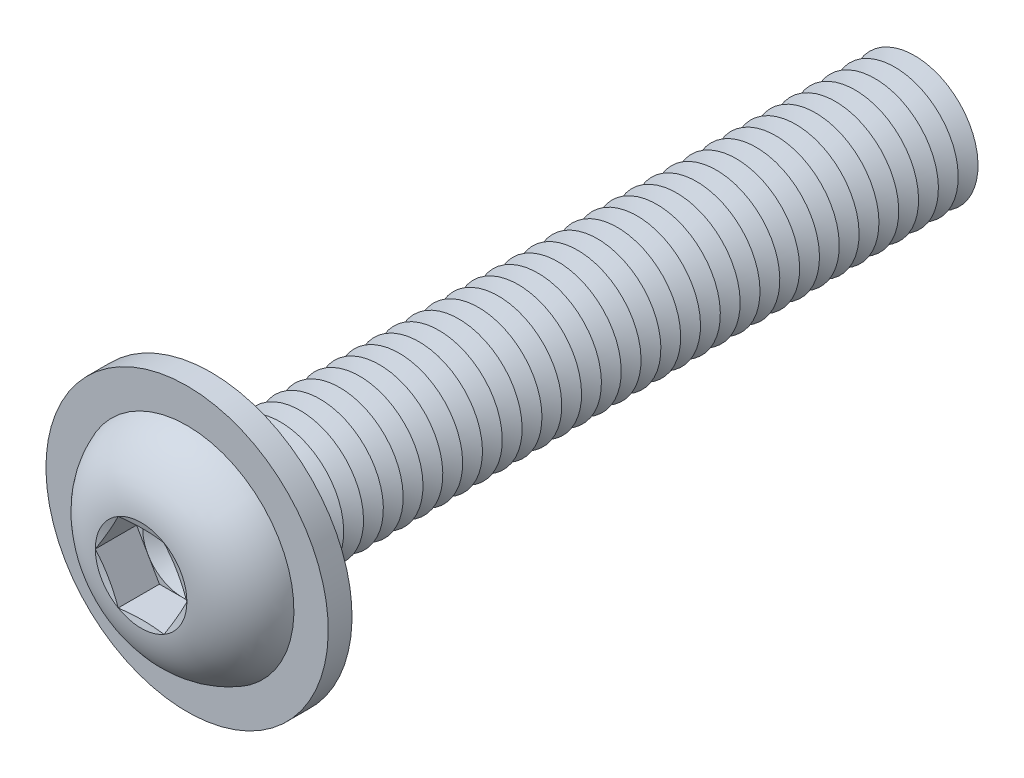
from build123d import *

# Parameters (mm, degrees)
FILLET1_R           = 0.625
LPATTERN1_COUNT     = 36
LPATTERN1_PITCH     = 1.25
CUT_EXTRUDE1_DEPTH  = 2.6
SKETCH5_R           = 8.9
SKETCH5_R_2         = 4.625
BOSS_EXTRUDE1_DEPTH = 1.5


with BuildPart() as part:
    # Sketch1 → Revolve1 (revolve)
    with BuildSketch(Plane(origin=(0, 0, 0), x_dir=(0, 0, -1), z_dir=(1, 0, 0))):
        with BuildLine():
            Line((0, 4), (0, 7))
            ThreePointArc((0, 7), (-3.011595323, 5.81154966), (-4.4, 2.88675))
            Line((-4.4, 2.88675), (-4.013248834, 1.443375))
            Line((-4.013248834, 1.443375), (-4.4, 1.443375))
            Line((-4.4, 1.443375), (-4.4, 0))
            Line((-4.4, 0), (45, 0))
            Line((45, 0), (45, 4))
            Line((45, 4), (0, 4))
        make_face()
    revolve(axis=Axis((0, 0, -45), (0, 0, 1)))

    # Fillet1
    fillet1_edges = [part.edges().sort_by_distance(p)[0] for p in [
        (0, -4, 0),
    ]]
    fillet(fillet1_edges, radius=FILLET1_R)

    # Sketch2 → Cut-Revolve1 (revolve, cut)
    with BuildSketch(Plane(origin=(0, 0, 0), x_dir=(0, 0, -1), z_dir=(1, 0, 0))):
        Polygon((44.375, 4), (45.625, 4), (45, 2.917468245), align=None)
    cut_revolve1 = revolve(axis=Axis((0, 0, -45), (0, 0, -1)), mode=Mode.SUBTRACT)

    # LPattern1: Cut-Revolve1 ×36
    with Locations(*[(0, 0, i * LPATTERN1_PITCH) for i in range(1, LPATTERN1_COUNT)]):
        add(cut_revolve1, mode=Mode.SUBTRACT)

    # Sketch3 → Cut-Extrude1 (cut)
    with BuildSketch(Plane.XY.offset(4.4)):
        Polygon((1.443375, 2.499998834), (-1.443375, 2.499998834), (-2.88675, 0), (-1.443375, -2.499998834), (1.443375, -2.499998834), (2.88675, 0), align=None)
    extrude(amount=-CUT_EXTRUDE1_DEPTH, mode=Mode.SUBTRACT)

    # Cut-Extrude2 cone 1 section (on through the dimple's axis) → Cut-Extrude2 (revolve, cut)
    with BuildSketch(Plane(origin=(0, 0, 1.8), x_dir=(0, -1, 0), z_dir=(1, 0, 0))):
        Polygon((0, 0), (2.499998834, 0), (0, 1.443375), align=None)
    revolve(axis=Axis((0, 0, 1.8), (0, 0, -1)), mode=Mode.SUBTRACT)

    # Sketch5 → Boss-Extrude1 (add)
    with BuildSketch(Plane(origin=(0, 0, 0), x_dir=(-1, 0, 0), z_dir=(0, 0, -1))):
        with Locations(Location((0, 0, 0), (0, 0, 90))):
            Circle(SKETCH5_R)
        Circle(SKETCH5_R_2, mode=Mode.SUBTRACT)
    extrude(amount=-BOSS_EXTRUDE1_DEPTH)


solid = part.part
